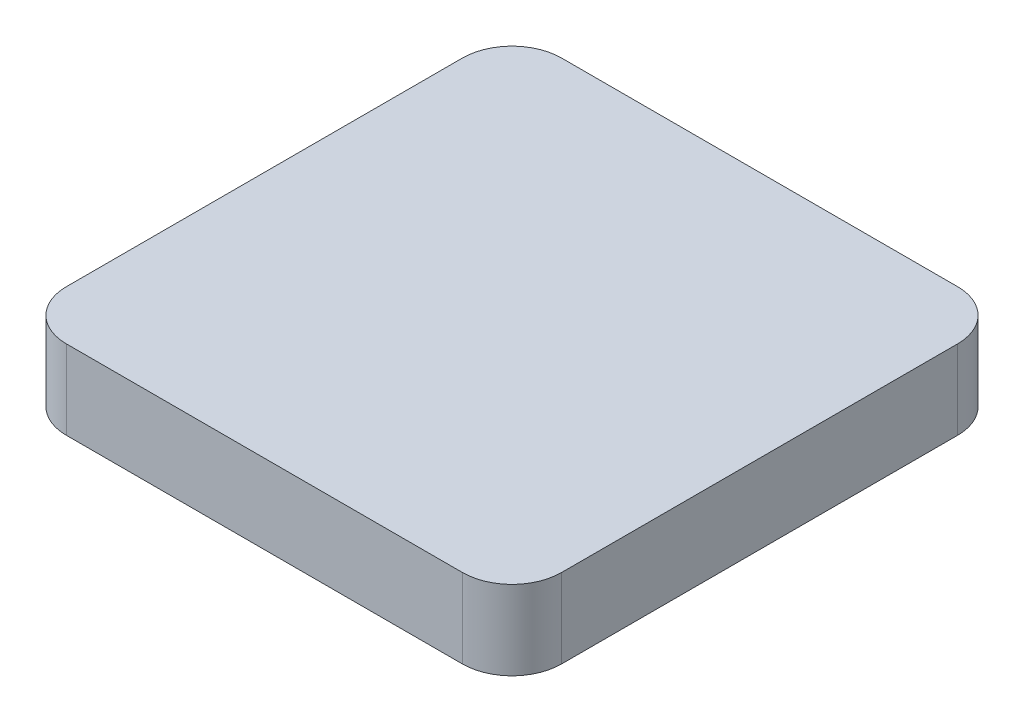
ISO-10303-21;
HEADER;
FILE_DESCRIPTION(('STEP AP214'),'2;1');
FILE_NAME('part.step','',(''),(''),'','','');
FILE_SCHEMA(('AUTOMOTIVE_DESIGN { 1 0 10303 214 1 1 1 1 }'));
ENDSEC;
DATA;
#1=APPLICATION_CONTEXT('core data for automotive mechanical design processes');
#2=APPLICATION_PROTOCOL_DEFINITION('international standard','automotive_design',2000,#1);
#3=PRODUCT_CONTEXT('',#1,'mechanical');
#4=PRODUCT('Part','Part','',(#3));
#5=PRODUCT_RELATED_PRODUCT_CATEGORY('part','',(#4));
#6=PRODUCT_DEFINITION_FORMATION('','',#4);
#7=PRODUCT_DEFINITION_CONTEXT('part definition',#1,'design');
#8=PRODUCT_DEFINITION('design','',#6,#7);
#9=PRODUCT_DEFINITION_SHAPE('','',#8);
#10=(LENGTH_UNIT() NAMED_UNIT(*) SI_UNIT(.MILLI.,.METRE.));
#11=(NAMED_UNIT(*) PLANE_ANGLE_UNIT() SI_UNIT($,.RADIAN.));
#12=(NAMED_UNIT(*) SI_UNIT($,.STERADIAN.) SOLID_ANGLE_UNIT());
#13=UNCERTAINTY_MEASURE_WITH_UNIT(LENGTH_MEASURE(1.E-05),#10,'distance_accuracy_value','');
#14=(GEOMETRIC_REPRESENTATION_CONTEXT(3) GLOBAL_UNCERTAINTY_ASSIGNED_CONTEXT((#13)) GLOBAL_UNIT_ASSIGNED_CONTEXT((#10,
#11,#12)) REPRESENTATION_CONTEXT('',''));
#15=CARTESIAN_POINT('',(0.,0.,0.));
#16=DIRECTION('',(0.,0.,1.));
#17=DIRECTION('',(1.,0.,0.));
#18=AXIS2_PLACEMENT_3D('',#15,#16,#17);
#19=CARTESIAN_POINT('',(1.2151442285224,2.55351295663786E-13,18.4848557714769));
#20=DIRECTION('',(0.,-1.,0.));
#21=DIRECTION('',(-1.,0.,0.));
#22=AXIS2_PLACEMENT_3D('',#19,#20,#21);
#23=PLANE('',#22);
#24=CARTESIAN_POINT('',(1.2151442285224,2.55351295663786E-13,18.4848557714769));
#25=DIRECTION('',(0.,1.,0.));
#26=DIRECTION('',(0.,0.,1.));
#27=AXIS2_PLACEMENT_3D('',#24,#25,#26);
#28=CIRCLE('',#27,2.5);
#29=CARTESIAN_POINT('',(-1.28485577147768,1.98063787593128E-13,18.484855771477));
#30=VERTEX_POINT('',#29);
#31=CARTESIAN_POINT('',(1.2151442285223,2.99094082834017E-13,20.9848557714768));
#32=VERTEX_POINT('',#31);
#33=EDGE_CURVE('E151',#30,#32,#28,.T.);
#34=ORIENTED_EDGE('',*,*,#33,.F.);
#35=DIRECTION('',(0.,0.,1.));
#36=VECTOR('',#35,1.);
#37=CARTESIAN_POINT('',(-1.28485577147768,1.98063787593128E-13,18.484855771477));
#38=LINE('',#37,#36);
#39=CARTESIAN_POINT('',(-1.28485577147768,4.16777723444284E-13,-1.51514422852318));
#40=VERTEX_POINT('',#39);
#41=EDGE_CURVE('E11',#40,#30,#38,.T.);
#42=ORIENTED_EDGE('',*,*,#41,.F.);
#43=CARTESIAN_POINT('',(1.2151442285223,3.04201108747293E-13,-1.51514422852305));
#44=DIRECTION('',(0.,1.,0.));
#45=DIRECTION('',(0.,0.,1.));
#46=AXIS2_PLACEMENT_3D('',#43,#44,#45);
#47=CIRCLE('',#46,2.5);
#48=CARTESIAN_POINT('',(1.21514422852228,4.30988578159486E-13,-4.01514422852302));
#49=VERTEX_POINT('',#48);
#50=EDGE_CURVE('E146',#49,#40,#47,.T.);
#51=ORIENTED_EDGE('',*,*,#50,.F.);
#52=DIRECTION('',(-1.,0.,0.));
#53=VECTOR('',#52,1.);
#54=CARTESIAN_POINT('',(1.21514422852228,4.30988578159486E-13,-4.01514422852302));
#55=LINE('',#54,#53);
#56=CARTESIAN_POINT('',(21.2151442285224,2.67341704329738E-13,-4.01514422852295));
#57=VERTEX_POINT('',#56);
#58=EDGE_CURVE('E147',#57,#49,#55,.T.);
#59=ORIENTED_EDGE('',*,*,#58,.F.);
#60=CARTESIAN_POINT('',(21.2151442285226,3.68149954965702E-13,-1.5151442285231));
#61=DIRECTION('',(0.,1.,0.));
#62=DIRECTION('',(0.,0.,1.));
#63=AXIS2_PLACEMENT_3D('',#60,#61,#62);
#64=CIRCLE('',#63,2.5);
#65=CARTESIAN_POINT('',(23.7151442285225,2.55129251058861E-13,-1.51514422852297));
#66=VERTEX_POINT('',#65);
#67=EDGE_CURVE('E57',#66,#57,#64,.T.);
#68=ORIENTED_EDGE('',*,*,#67,.F.);
#69=DIRECTION('',(0.,0.,-1.));
#70=VECTOR('',#69,1.);
#71=CARTESIAN_POINT('',(23.7151442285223,3.77475828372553E-13,18.4848557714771));
#72=LINE('',#71,#70);
#73=CARTESIAN_POINT('',(23.7151442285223,3.77475828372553E-13,18.4848557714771));
#74=VERTEX_POINT('',#73);
#75=EDGE_CURVE('E69',#74,#66,#72,.T.);
#76=ORIENTED_EDGE('',*,*,#75,.F.);
#77=CARTESIAN_POINT('',(21.2151442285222,4.33209024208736E-13,18.484855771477));
#78=DIRECTION('',(0.,1.,0.));
#79=DIRECTION('',(0.,0.,1.));
#80=AXIS2_PLACEMENT_3D('',#77,#78,#79);
#81=CIRCLE('',#80,2.5);
#82=CARTESIAN_POINT('',(21.2151442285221,3.06199510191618E-13,20.9848557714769));
#83=VERTEX_POINT('',#82);
#84=EDGE_CURVE('E120',#83,#74,#81,.T.);
#85=ORIENTED_EDGE('',*,*,#84,.F.);
#86=DIRECTION('',(1.,0.,0.));
#87=VECTOR('',#86,1.);
#88=CARTESIAN_POINT('',(1.2151442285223,2.99094082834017E-13,20.9848557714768));
#89=LINE('',#88,#87);
#90=EDGE_CURVE('E118',#32,#83,#89,.T.);
#91=ORIENTED_EDGE('',*,*,#90,.F.);
#92=EDGE_LOOP('',(#34,#42,#51,#59,#68,#76,#85,#91));
#93=FACE_BOUND('',#92,.T.);
#94=ADVANCED_FACE('F16',(#93),#23,.T.);
#95=CARTESIAN_POINT('',(-1.28485577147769,4.00000000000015,18.484855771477));
#96=DIRECTION('',(1.,0.,0.));
#97=DIRECTION('',(0.,-1.,0.));
#98=AXIS2_PLACEMENT_3D('',#95,#96,#97);
#99=PLANE('',#98);
#100=ORIENTED_EDGE('',*,*,#41,.T.);
#101=DIRECTION('',(0.,-1.,0.));
#102=VECTOR('',#101,1.);
#103=CARTESIAN_POINT('',(-1.28485577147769,4.00000000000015,18.484855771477));
#104=LINE('',#103,#102);
#105=CARTESIAN_POINT('',(-1.28485577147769,4.00000000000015,18.484855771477));
#106=VERTEX_POINT('',#105);
#107=EDGE_CURVE('E156',#106,#30,#104,.T.);
#108=ORIENTED_EDGE('',*,*,#107,.F.);
#109=DIRECTION('',(0.,0.,1.));
#110=VECTOR('',#109,1.);
#111=CARTESIAN_POINT('',(-1.28485577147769,4.00000000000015,18.484855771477));
#112=LINE('',#111,#110);
#113=CARTESIAN_POINT('',(-1.2848557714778,4.00000000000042,-1.51514422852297));
#114=VERTEX_POINT('',#113);
#115=EDGE_CURVE('E148',#114,#106,#112,.T.);
#116=ORIENTED_EDGE('',*,*,#115,.F.);
#117=DIRECTION('',(0.,-1.,0.));
#118=VECTOR('',#117,1.);
#119=CARTESIAN_POINT('',(-1.2848557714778,4.00000000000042,-1.51514422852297));
#120=LINE('',#119,#118);
#121=EDGE_CURVE('E27',#114,#40,#120,.T.);
#122=ORIENTED_EDGE('',*,*,#121,.T.);
#123=EDGE_LOOP('',(#100,#108,#116,#122));
#124=FACE_BOUND('',#123,.T.);
#125=ADVANCED_FACE('F229',(#124),#99,.F.);
#126=CARTESIAN_POINT('',(1.21514422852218,4.00000000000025,-1.51514422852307));
#127=DIRECTION('',(0.,1.,0.));
#128=DIRECTION('',(0.,0.,1.));
#129=AXIS2_PLACEMENT_3D('',#126,#127,#128);
#130=CYLINDRICAL_SURFACE('',#129,2.5);
#131=ORIENTED_EDGE('',*,*,#50,.T.);
#132=ORIENTED_EDGE('',*,*,#121,.F.);
#133=CARTESIAN_POINT('',(1.21514422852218,4.00000000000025,-1.51514422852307));
#134=DIRECTION('',(0.,1.,0.));
#135=DIRECTION('',(0.,0.,1.));
#136=AXIS2_PLACEMENT_3D('',#133,#134,#135);
#137=CIRCLE('',#136,2.5);
#138=CARTESIAN_POINT('',(1.2151442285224,4.00000000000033,-4.01514422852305));
#139=VERTEX_POINT('',#138);
#140=EDGE_CURVE('E152',#139,#114,#137,.T.);
#141=ORIENTED_EDGE('',*,*,#140,.F.);
#142=DIRECTION('',(0.,-1.,0.));
#143=VECTOR('',#142,1.);
#144=CARTESIAN_POINT('',(1.2151442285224,4.00000000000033,-4.01514422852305));
#145=LINE('',#144,#143);
#146=EDGE_CURVE('E142',#139,#49,#145,.T.);
#147=ORIENTED_EDGE('',*,*,#146,.T.);
#148=EDGE_LOOP('',(#131,#132,#141,#147));
#149=FACE_BOUND('',#148,.T.);
#150=ADVANCED_FACE('F205',(#149),#130,.T.);
#151=CARTESIAN_POINT('',(1.2151442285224,4.00000000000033,-4.01514422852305));
#152=DIRECTION('',(0.,0.,1.));
#153=DIRECTION('',(1.,0.,0.));
#154=AXIS2_PLACEMENT_3D('',#151,#152,#153);
#155=PLANE('',#154);
#156=ORIENTED_EDGE('',*,*,#58,.T.);
#157=ORIENTED_EDGE('',*,*,#146,.F.);
#158=DIRECTION('',(-1.,0.,0.));
#159=VECTOR('',#158,1.);
#160=CARTESIAN_POINT('',(1.2151442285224,4.00000000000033,-4.01514422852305));
#161=LINE('',#160,#159);
#162=CARTESIAN_POINT('',(21.2151442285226,4.00000000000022,-4.0151442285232));
#163=VERTEX_POINT('',#162);
#164=EDGE_CURVE('E191',#163,#139,#161,.T.);
#165=ORIENTED_EDGE('',*,*,#164,.F.);
#166=DIRECTION('',(0.,-1.,0.));
#167=VECTOR('',#166,1.);
#168=CARTESIAN_POINT('',(21.2151442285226,4.00000000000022,-4.0151442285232));
#169=LINE('',#168,#167);
#170=EDGE_CURVE('E166',#163,#57,#169,.T.);
#171=ORIENTED_EDGE('',*,*,#170,.T.);
#172=EDGE_LOOP('',(#156,#157,#165,#171));
#173=FACE_BOUND('',#172,.T.);
#174=ADVANCED_FACE('F18',(#173),#155,.F.);
#175=CARTESIAN_POINT('',(21.2151442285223,4.00000000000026,-1.515144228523));
#176=DIRECTION('',(0.,1.,0.));
#177=DIRECTION('',(0.,0.,1.));
#178=AXIS2_PLACEMENT_3D('',#175,#176,#177);
#179=CYLINDRICAL_SURFACE('',#178,2.5);
#180=ORIENTED_EDGE('',*,*,#67,.T.);
#181=ORIENTED_EDGE('',*,*,#170,.F.);
#182=CARTESIAN_POINT('',(21.2151442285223,4.00000000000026,-1.515144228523));
#183=DIRECTION('',(0.,1.,0.));
#184=DIRECTION('',(0.,0.,1.));
#185=AXIS2_PLACEMENT_3D('',#182,#183,#184);
#186=CIRCLE('',#185,2.5);
#187=CARTESIAN_POINT('',(23.7151442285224,4.00000000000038,-1.51514422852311));
#188=VERTEX_POINT('',#187);
#189=EDGE_CURVE('E161',#188,#163,#186,.T.);
#190=ORIENTED_EDGE('',*,*,#189,.F.);
#191=DIRECTION('',(0.,-1.,0.));
#192=VECTOR('',#191,1.);
#193=CARTESIAN_POINT('',(23.7151442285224,4.00000000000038,-1.51514422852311));
#194=LINE('',#193,#192);
#195=EDGE_CURVE('E20',#188,#66,#194,.T.);
#196=ORIENTED_EDGE('',*,*,#195,.T.);
#197=EDGE_LOOP('',(#180,#181,#190,#196));
#198=FACE_BOUND('',#197,.T.);
#199=ADVANCED_FACE('F215',(#198),#179,.T.);
#200=CARTESIAN_POINT('',(23.7151442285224,4.00000000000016,18.4848557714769));
#201=DIRECTION('',(-1.,0.,0.));
#202=DIRECTION('',(0.,0.,1.));
#203=AXIS2_PLACEMENT_3D('',#200,#201,#202);
#204=PLANE('',#203);
#205=ORIENTED_EDGE('',*,*,#75,.T.);
#206=ORIENTED_EDGE('',*,*,#195,.F.);
#207=DIRECTION('',(0.,0.,-1.));
#208=VECTOR('',#207,1.);
#209=CARTESIAN_POINT('',(23.7151442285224,4.00000000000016,18.4848557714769));
#210=LINE('',#209,#208);
#211=CARTESIAN_POINT('',(23.7151442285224,4.00000000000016,18.4848557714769));
#212=VERTEX_POINT('',#211);
#213=EDGE_CURVE('E128',#212,#188,#210,.T.);
#214=ORIENTED_EDGE('',*,*,#213,.F.);
#215=DIRECTION('',(0.,-1.,0.));
#216=VECTOR('',#215,1.);
#217=CARTESIAN_POINT('',(23.7151442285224,4.00000000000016,18.4848557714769));
#218=LINE('',#217,#216);
#219=EDGE_CURVE('E103',#212,#74,#218,.T.);
#220=ORIENTED_EDGE('',*,*,#219,.T.);
#221=EDGE_LOOP('',(#205,#206,#214,#220));
#222=FACE_BOUND('',#221,.T.);
#223=ADVANCED_FACE('F217',(#222),#204,.F.);
#224=CARTESIAN_POINT('',(21.2151442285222,4.00000000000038,18.4848557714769));
#225=DIRECTION('',(0.,1.,0.));
#226=DIRECTION('',(0.,0.,1.));
#227=AXIS2_PLACEMENT_3D('',#224,#225,#226);
#228=CYLINDRICAL_SURFACE('',#227,2.5);
#229=ORIENTED_EDGE('',*,*,#84,.T.);
#230=ORIENTED_EDGE('',*,*,#219,.F.);
#231=CARTESIAN_POINT('',(21.2151442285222,4.00000000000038,18.4848557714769));
#232=DIRECTION('',(0.,1.,0.));
#233=DIRECTION('',(0.,0.,1.));
#234=AXIS2_PLACEMENT_3D('',#231,#232,#233);
#235=CIRCLE('',#234,2.5);
#236=CARTESIAN_POINT('',(21.2151442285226,4.00000000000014,20.9848557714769));
#237=VERTEX_POINT('',#236);
#238=EDGE_CURVE('E123',#237,#212,#235,.T.);
#239=ORIENTED_EDGE('',*,*,#238,.F.);
#240=DIRECTION('',(0.,-1.,0.));
#241=VECTOR('',#240,1.);
#242=CARTESIAN_POINT('',(21.2151442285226,4.00000000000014,20.9848557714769));
#243=LINE('',#242,#241);
#244=EDGE_CURVE('E112',#237,#83,#243,.T.);
#245=ORIENTED_EDGE('',*,*,#244,.T.);
#246=EDGE_LOOP('',(#229,#230,#239,#245));
#247=FACE_BOUND('',#246,.T.);
#248=ADVANCED_FACE('F124',(#247),#228,.T.);
#249=CARTESIAN_POINT('',(1.2151442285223,4.00000000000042,20.9848557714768));
#250=DIRECTION('',(0.,0.,-1.));
#251=DIRECTION('',(0.,-1.,0.));
#252=AXIS2_PLACEMENT_3D('',#249,#250,#251);
#253=PLANE('',#252);
#254=ORIENTED_EDGE('',*,*,#90,.T.);
#255=ORIENTED_EDGE('',*,*,#244,.F.);
#256=DIRECTION('',(1.,0.,0.));
#257=VECTOR('',#256,1.);
#258=CARTESIAN_POINT('',(1.2151442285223,4.00000000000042,20.9848557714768));
#259=LINE('',#258,#257);
#260=CARTESIAN_POINT('',(1.2151442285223,4.00000000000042,20.9848557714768));
#261=VERTEX_POINT('',#260);
#262=EDGE_CURVE('E116',#261,#237,#259,.T.);
#263=ORIENTED_EDGE('',*,*,#262,.F.);
#264=DIRECTION('',(0.,-1.,0.));
#265=VECTOR('',#264,1.);
#266=CARTESIAN_POINT('',(1.2151442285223,4.00000000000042,20.9848557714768));
#267=LINE('',#266,#265);
#268=EDGE_CURVE('E153',#261,#32,#267,.T.);
#269=ORIENTED_EDGE('',*,*,#268,.T.);
#270=EDGE_LOOP('',(#254,#255,#263,#269));
#271=FACE_BOUND('',#270,.T.);
#272=ADVANCED_FACE('F113',(#271),#253,.F.);
#273=CARTESIAN_POINT('',(1.2151442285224,4.00000000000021,18.4848557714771));
#274=DIRECTION('',(0.,1.,0.));
#275=DIRECTION('',(0.,0.,1.));
#276=AXIS2_PLACEMENT_3D('',#273,#274,#275);
#277=CYLINDRICAL_SURFACE('',#276,2.5);
#278=ORIENTED_EDGE('',*,*,#33,.T.);
#279=ORIENTED_EDGE('',*,*,#268,.F.);
#280=CARTESIAN_POINT('',(1.2151442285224,4.00000000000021,18.4848557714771));
#281=DIRECTION('',(0.,1.,0.));
#282=DIRECTION('',(0.,0.,1.));
#283=AXIS2_PLACEMENT_3D('',#280,#281,#282);
#284=CIRCLE('',#283,2.5);
#285=EDGE_CURVE('E133',#106,#261,#284,.T.);
#286=ORIENTED_EDGE('',*,*,#285,.F.);
#287=ORIENTED_EDGE('',*,*,#107,.T.);
#288=EDGE_LOOP('',(#278,#279,#286,#287));
#289=FACE_BOUND('',#288,.T.);
#290=ADVANCED_FACE('F180',(#289),#277,.T.);
#291=CARTESIAN_POINT('',(1.2151442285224,4.00000000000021,18.4848557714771));
#292=DIRECTION('',(0.,-1.,0.));
#293=DIRECTION('',(-1.,0.,0.));
#294=AXIS2_PLACEMENT_3D('',#291,#292,#293);
#295=PLANE('',#294);
#296=ORIENTED_EDGE('',*,*,#285,.T.);
#297=ORIENTED_EDGE('',*,*,#262,.T.);
#298=ORIENTED_EDGE('',*,*,#238,.T.);
#299=ORIENTED_EDGE('',*,*,#213,.T.);
#300=ORIENTED_EDGE('',*,*,#189,.T.);
#301=ORIENTED_EDGE('',*,*,#164,.T.);
#302=ORIENTED_EDGE('',*,*,#140,.T.);
#303=ORIENTED_EDGE('',*,*,#115,.T.);
#304=EDGE_LOOP('',(#296,#297,#298,#299,#300,#301,#302,#303));
#305=FACE_BOUND('',#304,.T.);
#306=ADVANCED_FACE('F130',(#305),#295,.F.);
#307=CLOSED_SHELL('',(#94,#125,#150,#174,#199,#223,#248,#272,#290,#306));
#308=MANIFOLD_SOLID_BREP('B1',#307);
#309=ADVANCED_BREP_SHAPE_REPRESENTATION('',(#18,#308),#14);
#310=SHAPE_DEFINITION_REPRESENTATION(#9,#309);
ENDSEC;
END-ISO-10303-21;
